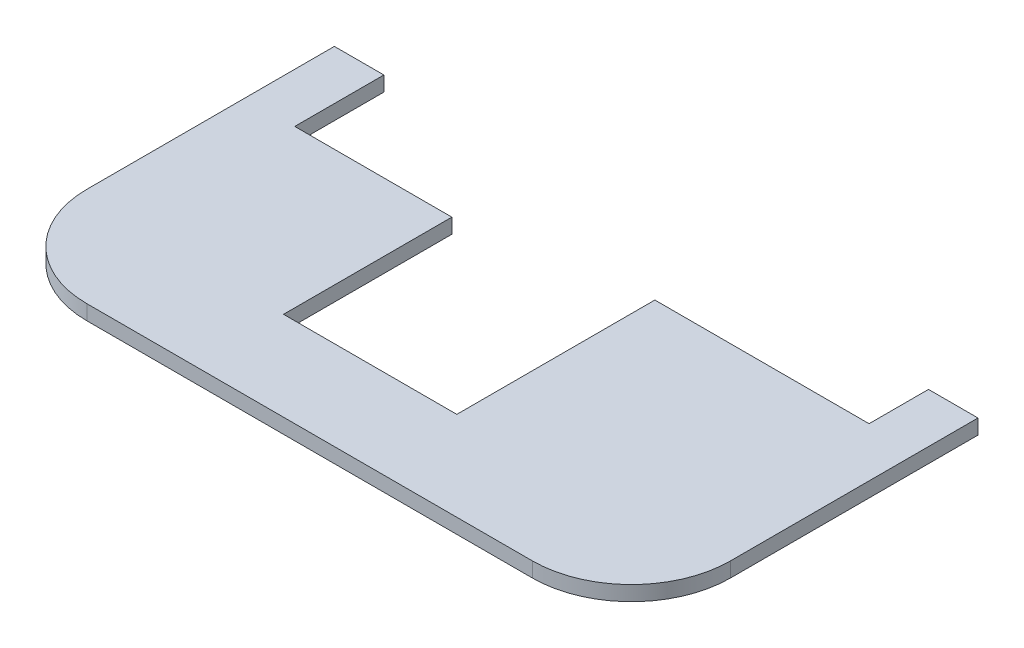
ISO-10303-21;
HEADER;
FILE_DESCRIPTION(('STEP AP214'),'2;1');
FILE_NAME('part.step','',(''),(''),'','','');
FILE_SCHEMA(('AUTOMOTIVE_DESIGN { 1 0 10303 214 1 1 1 1 }'));
ENDSEC;
DATA;
#1=APPLICATION_CONTEXT('core data for automotive mechanical design processes');
#2=APPLICATION_PROTOCOL_DEFINITION('international standard','automotive_design',2000,#1);
#3=PRODUCT_CONTEXT('',#1,'mechanical');
#4=PRODUCT('Part','Part','',(#3));
#5=PRODUCT_RELATED_PRODUCT_CATEGORY('part','',(#4));
#6=PRODUCT_DEFINITION_FORMATION('','',#4);
#7=PRODUCT_DEFINITION_CONTEXT('part definition',#1,'design');
#8=PRODUCT_DEFINITION('design','',#6,#7);
#9=PRODUCT_DEFINITION_SHAPE('','',#8);
#10=(LENGTH_UNIT() NAMED_UNIT(*) SI_UNIT(.MILLI.,.METRE.));
#11=(NAMED_UNIT(*) PLANE_ANGLE_UNIT() SI_UNIT($,.RADIAN.));
#12=(NAMED_UNIT(*) SI_UNIT($,.STERADIAN.) SOLID_ANGLE_UNIT());
#13=UNCERTAINTY_MEASURE_WITH_UNIT(LENGTH_MEASURE(1.E-05),#10,'distance_accuracy_value','');
#14=(GEOMETRIC_REPRESENTATION_CONTEXT(3) GLOBAL_UNCERTAINTY_ASSIGNED_CONTEXT((#13)) GLOBAL_UNIT_ASSIGNED_CONTEXT((#10,
#11,#12)) REPRESENTATION_CONTEXT('',''));
#15=CARTESIAN_POINT('',(0.,0.,0.));
#16=DIRECTION('',(0.,0.,1.));
#17=DIRECTION('',(1.,0.,0.));
#18=AXIS2_PLACEMENT_3D('',#15,#16,#17);
#19=CARTESIAN_POINT('',(0.,3.,-70.));
#20=DIRECTION('',(0.,0.,1.));
#21=DIRECTION('',(1.,0.,0.));
#22=AXIS2_PLACEMENT_3D('',#19,#20,#21);
#23=PLANE('',#22);
#24=DIRECTION('',(-1.,0.,0.));
#25=VECTOR('',#24,1.);
#26=CARTESIAN_POINT('',(0.,3.,-70.));
#27=LINE('',#26,#25);
#28=CARTESIAN_POINT('',(9.99999999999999,3.,-70.));
#29=VERTEX_POINT('',#28);
#30=CARTESIAN_POINT('',(0.,3.,-70.));
#31=VERTEX_POINT('',#30);
#32=EDGE_CURVE('E193',#29,#31,#27,.T.);
#33=ORIENTED_EDGE('',*,*,#32,.F.);
#34=DIRECTION('',(0.,1.,0.));
#35=VECTOR('',#34,1.);
#36=CARTESIAN_POINT('',(9.99999999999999,0.,-70.));
#37=LINE('',#36,#35);
#38=CARTESIAN_POINT('',(9.99999999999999,0.,-70.));
#39=VERTEX_POINT('',#38);
#40=EDGE_CURVE('E278',#39,#29,#37,.T.);
#41=ORIENTED_EDGE('',*,*,#40,.F.);
#42=DIRECTION('',(-1.,0.,0.));
#43=VECTOR('',#42,1.);
#44=CARTESIAN_POINT('',(0.,0.,-70.));
#45=LINE('',#44,#43);
#46=CARTESIAN_POINT('',(0.,0.,-70.));
#47=VERTEX_POINT('',#46);
#48=EDGE_CURVE('E152',#39,#47,#45,.T.);
#49=ORIENTED_EDGE('',*,*,#48,.T.);
#50=DIRECTION('',(0.,-1.,0.));
#51=VECTOR('',#50,1.);
#52=CARTESIAN_POINT('',(0.,3.,-70.));
#53=LINE('',#52,#51);
#54=EDGE_CURVE('E54',#31,#47,#53,.T.);
#55=ORIENTED_EDGE('',*,*,#54,.F.);
#56=EDGE_LOOP('',(#33,#41,#49,#55));
#57=FACE_BOUND('',#56,.T.);
#58=ADVANCED_FACE('F45',(#57),#23,.F.);
#59=CARTESIAN_POINT('',(130.,3.,-20.0000000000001));
#60=DIRECTION('',(-1.,0.,0.));
#61=DIRECTION('',(0.,0.,1.));
#62=AXIS2_PLACEMENT_3D('',#59,#60,#61);
#63=PLANE('',#62);
#64=DIRECTION('',(0.,0.,-1.));
#65=VECTOR('',#64,1.);
#66=CARTESIAN_POINT('',(130.,0.,-20.0000000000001));
#67=LINE('',#66,#65);
#68=CARTESIAN_POINT('',(130.,0.,-20.0000000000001));
#69=VERTEX_POINT('',#68);
#70=CARTESIAN_POINT('',(130.,0.,-70.));
#71=VERTEX_POINT('',#70);
#72=EDGE_CURVE('E148',#69,#71,#67,.T.);
#73=ORIENTED_EDGE('',*,*,#72,.T.);
#74=DIRECTION('',(0.,-1.,0.));
#75=VECTOR('',#74,1.);
#76=CARTESIAN_POINT('',(130.,3.,-70.));
#77=LINE('',#76,#75);
#78=CARTESIAN_POINT('',(130.,3.,-70.));
#79=VERTEX_POINT('',#78);
#80=EDGE_CURVE('E11',#79,#71,#77,.T.);
#81=ORIENTED_EDGE('',*,*,#80,.F.);
#82=DIRECTION('',(0.,0.,-1.));
#83=VECTOR('',#82,1.);
#84=CARTESIAN_POINT('',(130.,3.,-20.0000000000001));
#85=LINE('',#84,#83);
#86=CARTESIAN_POINT('',(130.,3.,-20.0000000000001));
#87=VERTEX_POINT('',#86);
#88=EDGE_CURVE('E168',#87,#79,#85,.T.);
#89=ORIENTED_EDGE('',*,*,#88,.F.);
#90=DIRECTION('',(0.,-1.,0.));
#91=VECTOR('',#90,1.);
#92=CARTESIAN_POINT('',(130.,3.,-20.0000000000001));
#93=LINE('',#92,#91);
#94=EDGE_CURVE('E144',#87,#69,#93,.T.);
#95=ORIENTED_EDGE('',*,*,#94,.T.);
#96=EDGE_LOOP('',(#73,#81,#89,#95));
#97=FACE_BOUND('',#96,.T.);
#98=ADVANCED_FACE('F47',(#97),#63,.F.);
#99=CARTESIAN_POINT('',(120.,0.,-70.));
#100=VERTEX_POINT('',#99);
#101=EDGE_CURVE('E154',#71,#100,#45,.T.);
#102=ORIENTED_EDGE('',*,*,#101,.T.);
#103=DIRECTION('',(0.,1.,0.));
#104=VECTOR('',#103,1.);
#105=CARTESIAN_POINT('',(120.,0.,-70.));
#106=LINE('',#105,#104);
#107=CARTESIAN_POINT('',(120.,3.,-70.));
#108=VERTEX_POINT('',#107);
#109=EDGE_CURVE('E281',#100,#108,#106,.T.);
#110=ORIENTED_EDGE('',*,*,#109,.T.);
#111=EDGE_CURVE('E105',#79,#108,#27,.T.);
#112=ORIENTED_EDGE('',*,*,#111,.F.);
#113=ORIENTED_EDGE('',*,*,#80,.T.);
#114=EDGE_LOOP('',(#102,#110,#112,#113));
#115=FACE_BOUND('',#114,.T.);
#116=ADVANCED_FACE('F343',(#115),#23,.F.);
#117=CARTESIAN_POINT('',(0.,3.,-20.0000000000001));
#118=DIRECTION('',(1.,0.,0.));
#119=DIRECTION('',(0.,0.,-1.));
#120=AXIS2_PLACEMENT_3D('',#117,#118,#119);
#121=PLANE('',#120);
#122=DIRECTION('',(0.,0.,1.));
#123=VECTOR('',#122,1.);
#124=CARTESIAN_POINT('',(0.,0.,-20.0000000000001));
#125=LINE('',#124,#123);
#126=CARTESIAN_POINT('',(0.,0.,-20.0000000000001));
#127=VERTEX_POINT('',#126);
#128=EDGE_CURVE('E158',#47,#127,#125,.T.);
#129=ORIENTED_EDGE('',*,*,#128,.T.);
#130=DIRECTION('',(0.,-1.,0.));
#131=VECTOR('',#130,1.);
#132=CARTESIAN_POINT('',(0.,3.,-20.0000000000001));
#133=LINE('',#132,#131);
#134=CARTESIAN_POINT('',(0.,3.,-20.0000000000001));
#135=VERTEX_POINT('',#134);
#136=EDGE_CURVE('E137',#135,#127,#133,.T.);
#137=ORIENTED_EDGE('',*,*,#136,.F.);
#138=DIRECTION('',(0.,0.,1.));
#139=VECTOR('',#138,1.);
#140=CARTESIAN_POINT('',(0.,3.,-20.0000000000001));
#141=LINE('',#140,#139);
#142=EDGE_CURVE('E123',#31,#135,#141,.T.);
#143=ORIENTED_EDGE('',*,*,#142,.F.);
#144=ORIENTED_EDGE('',*,*,#54,.T.);
#145=EDGE_LOOP('',(#129,#137,#143,#144));
#146=FACE_BOUND('',#145,.T.);
#147=ADVANCED_FACE('F179',(#146),#121,.F.);
#148=CARTESIAN_POINT('',(20.,3.,-20.));
#149=DIRECTION('',(0.,-1.,0.));
#150=DIRECTION('',(0.,0.,-1.));
#151=AXIS2_PLACEMENT_3D('',#148,#149,#150);
#152=CYLINDRICAL_SURFACE('',#151,20.);
#153=CARTESIAN_POINT('',(20.,0.,-20.));
#154=DIRECTION('',(0.,1.,0.));
#155=DIRECTION('',(0.,0.,-1.));
#156=AXIS2_PLACEMENT_3D('',#153,#154,#155);
#157=CIRCLE('',#156,20.);
#158=CARTESIAN_POINT('',(20.0000000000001,0.,0.));
#159=VERTEX_POINT('',#158);
#160=EDGE_CURVE('E133',#127,#159,#157,.T.);
#161=ORIENTED_EDGE('',*,*,#160,.T.);
#162=DIRECTION('',(0.,-1.,0.));
#163=VECTOR('',#162,1.);
#164=CARTESIAN_POINT('',(20.0000000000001,3.,0.));
#165=LINE('',#164,#163);
#166=CARTESIAN_POINT('',(20.0000000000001,3.,0.));
#167=VERTEX_POINT('',#166);
#168=EDGE_CURVE('E130',#167,#159,#165,.T.);
#169=ORIENTED_EDGE('',*,*,#168,.F.);
#170=CARTESIAN_POINT('',(20.,3.,-20.));
#171=DIRECTION('',(0.,1.,0.));
#172=DIRECTION('',(0.,0.,-1.));
#173=AXIS2_PLACEMENT_3D('',#170,#171,#172);
#174=CIRCLE('',#173,20.);
#175=EDGE_CURVE('E115',#135,#167,#174,.T.);
#176=ORIENTED_EDGE('',*,*,#175,.F.);
#177=ORIENTED_EDGE('',*,*,#136,.T.);
#178=EDGE_LOOP('',(#161,#169,#176,#177));
#179=FACE_BOUND('',#178,.T.);
#180=ADVANCED_FACE('F131',(#179),#152,.T.);
#181=CARTESIAN_POINT('',(20.0000000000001,3.,0.));
#182=DIRECTION('',(0.,0.,-1.));
#183=DIRECTION('',(-1.,0.,0.));
#184=AXIS2_PLACEMENT_3D('',#181,#182,#183);
#185=PLANE('',#184);
#186=DIRECTION('',(1.,0.,0.));
#187=VECTOR('',#186,1.);
#188=CARTESIAN_POINT('',(20.0000000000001,0.,0.));
#189=LINE('',#188,#187);
#190=CARTESIAN_POINT('',(110.,0.,0.));
#191=VERTEX_POINT('',#190);
#192=EDGE_CURVE('E163',#159,#191,#189,.T.);
#193=ORIENTED_EDGE('',*,*,#192,.T.);
#194=DIRECTION('',(0.,-1.,0.));
#195=VECTOR('',#194,1.);
#196=CARTESIAN_POINT('',(110.,3.,0.));
#197=LINE('',#196,#195);
#198=CARTESIAN_POINT('',(110.,3.,0.));
#199=VERTEX_POINT('',#198);
#200=EDGE_CURVE('E138',#199,#191,#197,.T.);
#201=ORIENTED_EDGE('',*,*,#200,.F.);
#202=DIRECTION('',(1.,0.,0.));
#203=VECTOR('',#202,1.);
#204=CARTESIAN_POINT('',(20.0000000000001,3.,0.));
#205=LINE('',#204,#203);
#206=EDGE_CURVE('E120',#167,#199,#205,.T.);
#207=ORIENTED_EDGE('',*,*,#206,.F.);
#208=ORIENTED_EDGE('',*,*,#168,.T.);
#209=EDGE_LOOP('',(#193,#201,#207,#208));
#210=FACE_BOUND('',#209,.T.);
#211=ADVANCED_FACE('F140',(#210),#185,.F.);
#212=CARTESIAN_POINT('',(110.,3.,-20.));
#213=DIRECTION('',(0.,-1.,0.));
#214=DIRECTION('',(0.,0.,-1.));
#215=AXIS2_PLACEMENT_3D('',#212,#213,#214);
#216=CYLINDRICAL_SURFACE('',#215,20.);
#217=CARTESIAN_POINT('',(110.,0.,-20.));
#218=DIRECTION('',(0.,1.,0.));
#219=DIRECTION('',(0.,0.,1.));
#220=AXIS2_PLACEMENT_3D('',#217,#218,#219);
#221=CIRCLE('',#220,20.);
#222=EDGE_CURVE('E97',#191,#69,#221,.T.);
#223=ORIENTED_EDGE('',*,*,#222,.T.);
#224=ORIENTED_EDGE('',*,*,#94,.F.);
#225=CARTESIAN_POINT('',(110.,3.,-20.));
#226=DIRECTION('',(0.,1.,0.));
#227=DIRECTION('',(0.,0.,1.));
#228=AXIS2_PLACEMENT_3D('',#225,#226,#227);
#229=CIRCLE('',#228,20.);
#230=EDGE_CURVE('E70',#199,#87,#229,.T.);
#231=ORIENTED_EDGE('',*,*,#230,.F.);
#232=ORIENTED_EDGE('',*,*,#200,.T.);
#233=EDGE_LOOP('',(#223,#224,#231,#232));
#234=FACE_BOUND('',#233,.T.);
#235=ADVANCED_FACE('F188',(#234),#216,.T.);
#236=CARTESIAN_POINT('',(20.,3.,-20.));
#237=DIRECTION('',(0.,-1.,0.));
#238=DIRECTION('',(0.,0.,-1.));
#239=AXIS2_PLACEMENT_3D('',#236,#237,#238);
#240=PLANE('',#239);
#241=DIRECTION('',(-1.,0.,0.));
#242=VECTOR('',#241,1.);
#243=CARTESIAN_POINT('',(20.,3.,-52.));
#244=LINE('',#243,#242);
#245=CARTESIAN_POINT('',(41.7316617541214,3.,-52.));
#246=VERTEX_POINT('',#245);
#247=CARTESIAN_POINT('',(10.,3.,-52.));
#248=VERTEX_POINT('',#247);
#249=EDGE_CURVE('E258',#246,#248,#244,.T.);
#250=ORIENTED_EDGE('',*,*,#249,.T.);
#251=DIRECTION('',(0.,0.,-1.));
#252=VECTOR('',#251,1.);
#253=CARTESIAN_POINT('',(10.,3.,-20.));
#254=LINE('',#253,#252);
#255=EDGE_CURVE('E261',#248,#29,#254,.T.);
#256=ORIENTED_EDGE('',*,*,#255,.T.);
#257=ORIENTED_EDGE('',*,*,#32,.T.);
#258=ORIENTED_EDGE('',*,*,#142,.T.);
#259=ORIENTED_EDGE('',*,*,#175,.T.);
#260=ORIENTED_EDGE('',*,*,#206,.T.);
#261=ORIENTED_EDGE('',*,*,#230,.T.);
#262=ORIENTED_EDGE('',*,*,#88,.T.);
#263=ORIENTED_EDGE('',*,*,#111,.T.);
#264=DIRECTION('',(0.,0.,1.));
#265=VECTOR('',#264,1.);
#266=CARTESIAN_POINT('',(120.,3.,-20.));
#267=LINE('',#266,#265);
#268=CARTESIAN_POINT('',(120.,3.,-58.));
#269=VERTEX_POINT('',#268);
#270=EDGE_CURVE('E206',#108,#269,#267,.T.);
#271=ORIENTED_EDGE('',*,*,#270,.T.);
#272=DIRECTION('',(-1.,0.,0.));
#273=VECTOR('',#272,1.);
#274=CARTESIAN_POINT('',(20.,3.,-58.));
#275=LINE('',#274,#273);
#276=CARTESIAN_POINT('',(76.7316617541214,3.,-58.));
#277=VERTEX_POINT('',#276);
#278=EDGE_CURVE('E251',#269,#277,#275,.T.);
#279=ORIENTED_EDGE('',*,*,#278,.T.);
#280=DIRECTION('',(0.,0.,1.));
#281=VECTOR('',#280,1.);
#282=CARTESIAN_POINT('',(76.7316617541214,3.,-20.));
#283=LINE('',#282,#281);
#284=CARTESIAN_POINT('',(76.7316617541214,3.,-18.));
#285=VERTEX_POINT('',#284);
#286=EDGE_CURVE('E153',#277,#285,#283,.T.);
#287=ORIENTED_EDGE('',*,*,#286,.T.);
#288=DIRECTION('',(-1.,0.,0.));
#289=VECTOR('',#288,1.);
#290=CARTESIAN_POINT('',(20.,3.,-18.));
#291=LINE('',#290,#289);
#292=CARTESIAN_POINT('',(41.7316617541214,3.,-18.));
#293=VERTEX_POINT('',#292);
#294=EDGE_CURVE('E233',#285,#293,#291,.T.);
#295=ORIENTED_EDGE('',*,*,#294,.T.);
#296=DIRECTION('',(0.,0.,-1.));
#297=VECTOR('',#296,1.);
#298=CARTESIAN_POINT('',(41.7316617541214,3.,-20.));
#299=LINE('',#298,#297);
#300=EDGE_CURVE('E227',#293,#246,#299,.T.);
#301=ORIENTED_EDGE('',*,*,#300,.T.);
#302=EDGE_LOOP('',(#250,#256,#257,#258,#259,#260,#261,#262,#263,#271,#279,#287,#295,#301));
#303=FACE_BOUND('',#302,.T.);
#304=ADVANCED_FACE('F118',(#303),#240,.F.);
#305=CARTESIAN_POINT('',(20.,0.,-20.));
#306=DIRECTION('',(0.,-1.,0.));
#307=DIRECTION('',(0.,0.,-1.));
#308=AXIS2_PLACEMENT_3D('',#305,#306,#307);
#309=PLANE('',#308);
#310=DIRECTION('',(0.,0.,1.));
#311=VECTOR('',#310,1.);
#312=CARTESIAN_POINT('',(9.99999999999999,0.,-70.));
#313=LINE('',#312,#311);
#314=CARTESIAN_POINT('',(10.,0.,-52.));
#315=VERTEX_POINT('',#314);
#316=EDGE_CURVE('E301',#39,#315,#313,.T.);
#317=ORIENTED_EDGE('',*,*,#316,.T.);
#318=DIRECTION('',(1.,0.,0.));
#319=VECTOR('',#318,1.);
#320=CARTESIAN_POINT('',(10.,0.,-52.));
#321=LINE('',#320,#319);
#322=CARTESIAN_POINT('',(41.7316617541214,0.,-52.));
#323=VERTEX_POINT('',#322);
#324=EDGE_CURVE('E297',#315,#323,#321,.T.);
#325=ORIENTED_EDGE('',*,*,#324,.T.);
#326=DIRECTION('',(0.,0.,1.));
#327=VECTOR('',#326,1.);
#328=CARTESIAN_POINT('',(41.7316617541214,0.,-52.));
#329=LINE('',#328,#327);
#330=CARTESIAN_POINT('',(41.7316617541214,0.,-18.));
#331=VERTEX_POINT('',#330);
#332=EDGE_CURVE('E293',#323,#331,#329,.T.);
#333=ORIENTED_EDGE('',*,*,#332,.T.);
#334=DIRECTION('',(1.,0.,0.));
#335=VECTOR('',#334,1.);
#336=CARTESIAN_POINT('',(41.7316617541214,0.,-18.));
#337=LINE('',#336,#335);
#338=CARTESIAN_POINT('',(76.7316617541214,0.,-18.));
#339=VERTEX_POINT('',#338);
#340=EDGE_CURVE('E290',#331,#339,#337,.T.);
#341=ORIENTED_EDGE('',*,*,#340,.T.);
#342=DIRECTION('',(0.,0.,-1.));
#343=VECTOR('',#342,1.);
#344=CARTESIAN_POINT('',(76.7316617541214,0.,-58.));
#345=LINE('',#344,#343);
#346=CARTESIAN_POINT('',(76.7316617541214,0.,-58.));
#347=VERTEX_POINT('',#346);
#348=EDGE_CURVE('E248',#339,#347,#345,.T.);
#349=ORIENTED_EDGE('',*,*,#348,.T.);
#350=DIRECTION('',(1.,0.,0.));
#351=VECTOR('',#350,1.);
#352=CARTESIAN_POINT('',(76.7316617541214,0.,-58.));
#353=LINE('',#352,#351);
#354=CARTESIAN_POINT('',(120.,0.,-58.));
#355=VERTEX_POINT('',#354);
#356=EDGE_CURVE('E306',#347,#355,#353,.T.);
#357=ORIENTED_EDGE('',*,*,#356,.T.);
#358=DIRECTION('',(0.,0.,-1.));
#359=VECTOR('',#358,1.);
#360=CARTESIAN_POINT('',(120.,0.,-70.));
#361=LINE('',#360,#359);
#362=EDGE_CURVE('E61',#355,#100,#361,.T.);
#363=ORIENTED_EDGE('',*,*,#362,.T.);
#364=ORIENTED_EDGE('',*,*,#101,.F.);
#365=ORIENTED_EDGE('',*,*,#72,.F.);
#366=ORIENTED_EDGE('',*,*,#222,.F.);
#367=ORIENTED_EDGE('',*,*,#192,.F.);
#368=ORIENTED_EDGE('',*,*,#160,.F.);
#369=ORIENTED_EDGE('',*,*,#128,.F.);
#370=ORIENTED_EDGE('',*,*,#48,.F.);
#371=EDGE_LOOP('',(#317,#325,#333,#341,#349,#357,#363,#364,#365,#366,#367,#368,#369,#370));
#372=FACE_BOUND('',#371,.T.);
#373=ADVANCED_FACE('F185',(#372),#309,.T.);
#374=CARTESIAN_POINT('',(76.7316617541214,0.,-58.));
#375=DIRECTION('',(1.,0.,0.));
#376=DIRECTION('',(0.,0.,-1.));
#377=AXIS2_PLACEMENT_3D('',#374,#375,#376);
#378=PLANE('',#377);
#379=DIRECTION('',(0.,1.,0.));
#380=VECTOR('',#379,1.);
#381=CARTESIAN_POINT('',(76.7316617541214,0.,-58.));
#382=LINE('',#381,#380);
#383=EDGE_CURVE('E287',#347,#277,#382,.T.);
#384=ORIENTED_EDGE('',*,*,#383,.F.);
#385=ORIENTED_EDGE('',*,*,#348,.F.);
#386=DIRECTION('',(0.,1.,0.));
#387=VECTOR('',#386,1.);
#388=CARTESIAN_POINT('',(76.7316617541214,0.,-18.));
#389=LINE('',#388,#387);
#390=EDGE_CURVE('E238',#339,#285,#389,.T.);
#391=ORIENTED_EDGE('',*,*,#390,.T.);
#392=ORIENTED_EDGE('',*,*,#286,.F.);
#393=EDGE_LOOP('',(#384,#385,#391,#392));
#394=FACE_BOUND('',#393,.T.);
#395=ADVANCED_FACE('F245',(#394),#378,.F.);
#396=CARTESIAN_POINT('',(41.7316617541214,0.,-18.));
#397=DIRECTION('',(0.,0.,1.));
#398=DIRECTION('',(1.,0.,0.));
#399=AXIS2_PLACEMENT_3D('',#396,#397,#398);
#400=PLANE('',#399);
#401=ORIENTED_EDGE('',*,*,#390,.F.);
#402=ORIENTED_EDGE('',*,*,#340,.F.);
#403=DIRECTION('',(0.,1.,0.));
#404=VECTOR('',#403,1.);
#405=CARTESIAN_POINT('',(41.7316617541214,0.,-18.));
#406=LINE('',#405,#404);
#407=EDGE_CURVE('E240',#331,#293,#406,.T.);
#408=ORIENTED_EDGE('',*,*,#407,.T.);
#409=ORIENTED_EDGE('',*,*,#294,.F.);
#410=EDGE_LOOP('',(#401,#402,#408,#409));
#411=FACE_BOUND('',#410,.T.);
#412=ADVANCED_FACE('F235',(#411),#400,.F.);
#413=CARTESIAN_POINT('',(41.7316617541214,0.,-52.));
#414=DIRECTION('',(-1.,0.,0.));
#415=DIRECTION('',(0.,0.,1.));
#416=AXIS2_PLACEMENT_3D('',#413,#414,#415);
#417=PLANE('',#416);
#418=ORIENTED_EDGE('',*,*,#407,.F.);
#419=ORIENTED_EDGE('',*,*,#332,.F.);
#420=DIRECTION('',(0.,1.,0.));
#421=VECTOR('',#420,1.);
#422=CARTESIAN_POINT('',(41.7316617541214,0.,-52.));
#423=LINE('',#422,#421);
#424=EDGE_CURVE('E271',#323,#246,#423,.T.);
#425=ORIENTED_EDGE('',*,*,#424,.T.);
#426=ORIENTED_EDGE('',*,*,#300,.F.);
#427=EDGE_LOOP('',(#418,#419,#425,#426));
#428=FACE_BOUND('',#427,.T.);
#429=ADVANCED_FACE('F369',(#428),#417,.F.);
#430=CARTESIAN_POINT('',(10.,0.,-52.));
#431=DIRECTION('',(0.,0.,1.));
#432=DIRECTION('',(1.,0.,0.));
#433=AXIS2_PLACEMENT_3D('',#430,#431,#432);
#434=PLANE('',#433);
#435=ORIENTED_EDGE('',*,*,#424,.F.);
#436=ORIENTED_EDGE('',*,*,#324,.F.);
#437=DIRECTION('',(0.,1.,0.));
#438=VECTOR('',#437,1.);
#439=CARTESIAN_POINT('',(10.,0.,-52.));
#440=LINE('',#439,#438);
#441=EDGE_CURVE('E274',#315,#248,#440,.T.);
#442=ORIENTED_EDGE('',*,*,#441,.T.);
#443=ORIENTED_EDGE('',*,*,#249,.F.);
#444=EDGE_LOOP('',(#435,#436,#442,#443));
#445=FACE_BOUND('',#444,.T.);
#446=ADVANCED_FACE('F339',(#445),#434,.F.);
#447=CARTESIAN_POINT('',(10.,0.,-58.));
#448=DIRECTION('',(-1.,0.,0.));
#449=DIRECTION('',(0.,0.,1.));
#450=AXIS2_PLACEMENT_3D('',#447,#448,#449);
#451=PLANE('',#450);
#452=ORIENTED_EDGE('',*,*,#441,.F.);
#453=ORIENTED_EDGE('',*,*,#316,.F.);
#454=ORIENTED_EDGE('',*,*,#40,.T.);
#455=ORIENTED_EDGE('',*,*,#255,.F.);
#456=EDGE_LOOP('',(#452,#453,#454,#455));
#457=FACE_BOUND('',#456,.T.);
#458=ADVANCED_FACE('F332',(#457),#451,.F.);
#459=CARTESIAN_POINT('',(120.,0.,-70.));
#460=DIRECTION('',(1.,0.,0.));
#461=DIRECTION('',(0.,0.,-1.));
#462=AXIS2_PLACEMENT_3D('',#459,#460,#461);
#463=PLANE('',#462);
#464=ORIENTED_EDGE('',*,*,#109,.F.);
#465=ORIENTED_EDGE('',*,*,#362,.F.);
#466=DIRECTION('',(0.,1.,0.));
#467=VECTOR('',#466,1.);
#468=CARTESIAN_POINT('',(120.,0.,-58.));
#469=LINE('',#468,#467);
#470=EDGE_CURVE('E284',#355,#269,#469,.T.);
#471=ORIENTED_EDGE('',*,*,#470,.T.);
#472=ORIENTED_EDGE('',*,*,#270,.F.);
#473=EDGE_LOOP('',(#464,#465,#471,#472));
#474=FACE_BOUND('',#473,.T.);
#475=ADVANCED_FACE('F330',(#474),#463,.F.);
#476=CARTESIAN_POINT('',(76.7316617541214,0.,-58.));
#477=DIRECTION('',(0.,0.,1.));
#478=DIRECTION('',(1.,0.,0.));
#479=AXIS2_PLACEMENT_3D('',#476,#477,#478);
#480=PLANE('',#479);
#481=ORIENTED_EDGE('',*,*,#470,.F.);
#482=ORIENTED_EDGE('',*,*,#356,.F.);
#483=ORIENTED_EDGE('',*,*,#383,.T.);
#484=ORIENTED_EDGE('',*,*,#278,.F.);
#485=EDGE_LOOP('',(#481,#482,#483,#484));
#486=FACE_BOUND('',#485,.T.);
#487=ADVANCED_FACE('F329',(#486),#480,.F.);
#488=CLOSED_SHELL('',(#58,#98,#116,#147,#180,#211,#235,#304,#373,#395,#412,#429,#446,#458,#475,#487));
#489=MANIFOLD_SOLID_BREP('B2',#488);
#490=ADVANCED_BREP_SHAPE_REPRESENTATION('',(#18,#489),#14);
#491=SHAPE_DEFINITION_REPRESENTATION(#9,#490);
ENDSEC;
END-ISO-10303-21;
